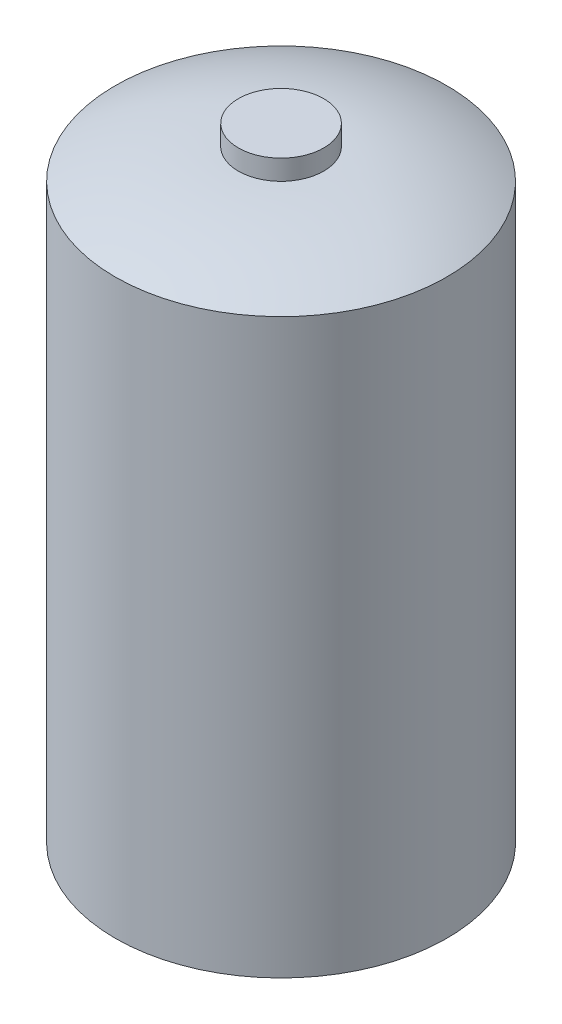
ISO-10303-21;
HEADER;
FILE_DESCRIPTION(('STEP AP214'),'2;1');
FILE_NAME('part.step','',(''),(''),'','','');
FILE_SCHEMA(('AUTOMOTIVE_DESIGN { 1 0 10303 214 1 1 1 1 }'));
ENDSEC;
DATA;
#1=APPLICATION_CONTEXT('core data for automotive mechanical design processes');
#2=APPLICATION_PROTOCOL_DEFINITION('international standard','automotive_design',2000,#1);
#3=PRODUCT_CONTEXT('',#1,'mechanical');
#4=PRODUCT('Part','Part','',(#3));
#5=PRODUCT_RELATED_PRODUCT_CATEGORY('part','',(#4));
#6=PRODUCT_DEFINITION_FORMATION('','',#4);
#7=PRODUCT_DEFINITION_CONTEXT('part definition',#1,'design');
#8=PRODUCT_DEFINITION('design','',#6,#7);
#9=PRODUCT_DEFINITION_SHAPE('','',#8);
#10=(LENGTH_UNIT() NAMED_UNIT(*) SI_UNIT(.MILLI.,.METRE.));
#11=(NAMED_UNIT(*) PLANE_ANGLE_UNIT() SI_UNIT($,.RADIAN.));
#12=(NAMED_UNIT(*) SI_UNIT($,.STERADIAN.) SOLID_ANGLE_UNIT());
#13=UNCERTAINTY_MEASURE_WITH_UNIT(LENGTH_MEASURE(1.E-05),#10,'distance_accuracy_value','');
#14=(GEOMETRIC_REPRESENTATION_CONTEXT(3) GLOBAL_UNCERTAINTY_ASSIGNED_CONTEXT((#13)) GLOBAL_UNIT_ASSIGNED_CONTEXT((#10,
#11,#12)) REPRESENTATION_CONTEXT('',''));
#15=CARTESIAN_POINT('',(0.,0.,0.));
#16=DIRECTION('',(0.,0.,1.));
#17=DIRECTION('',(1.,0.,0.));
#18=AXIS2_PLACEMENT_3D('',#15,#16,#17);
#19=CARTESIAN_POINT('',(0.,0.,0.));
#20=DIRECTION('',(0.,-1.,0.));
#21=DIRECTION('',(0.,0.,-1.));
#22=AXIS2_PLACEMENT_3D('',#19,#20,#21);
#23=PLANE('',#22);
#24=CARTESIAN_POINT('',(0.,0.,0.));
#25=DIRECTION('',(0.,1.,0.));
#26=DIRECTION('',(0.,0.,1.));
#27=AXIS2_PLACEMENT_3D('',#24,#25,#26);
#28=CIRCLE('',#27,4.25);
#29=CARTESIAN_POINT('',(0.,0.,4.25));
#30=VERTEX_POINT('',#29);
#31=EDGE_CURVE('E10',#30,#30,#28,.T.);
#32=ORIENTED_EDGE('',*,*,#31,.T.);
#33=EDGE_LOOP('',(#32));
#34=FACE_BOUND('',#33,.T.);
#35=ADVANCED_FACE('F31',(#34),#23,.F.);
#36=CARTESIAN_POINT('',(0.,0.,0.));
#37=DIRECTION('',(0.,1.,0.));
#38=DIRECTION('',(0.,0.,1.));
#39=AXIS2_PLACEMENT_3D('',#36,#37,#38);
#40=CYLINDRICAL_SURFACE('',#39,4.25);
#41=ORIENTED_EDGE('',*,*,#31,.F.);
#42=EDGE_LOOP('',(#41));
#43=FACE_BOUND('',#42,.T.);
#44=CARTESIAN_POINT('',(0.,-2.,0.));
#45=DIRECTION('',(0.,1.,0.));
#46=DIRECTION('',(0.,0.,1.));
#47=AXIS2_PLACEMENT_3D('',#44,#45,#46);
#48=CIRCLE('',#47,4.25);
#49=CARTESIAN_POINT('',(0.,-2.,4.25));
#50=VERTEX_POINT('',#49);
#51=EDGE_CURVE('E37',#50,#50,#48,.T.);
#52=ORIENTED_EDGE('',*,*,#51,.T.);
#53=EDGE_LOOP('',(#52));
#54=FACE_BOUND('',#53,.T.);
#55=ADVANCED_FACE('F63',(#43,#54),#40,.T.);
#56=CARTESIAN_POINT('',(0.,-28.5104166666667,0.));
#57=DIRECTION('',(0.,1.,0.));
#58=DIRECTION('',(0.,0.,1.));
#59=AXIS2_PLACEMENT_3D('',#56,#57,#58);
#60=DEGENERATE_TOROIDAL_SURFACE('',#59,4.25,26.5104166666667,.T.);
#61=ORIENTED_EDGE('',*,*,#51,.F.);
#62=EDGE_LOOP('',(#61));
#63=FACE_BOUND('',#62,.T.);
#64=CARTESIAN_POINT('',(0.,-4.99999999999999,0.));
#65=DIRECTION('',(0.,1.,0.));
#66=DIRECTION('',(0.,0.,1.));
#67=AXIS2_PLACEMENT_3D('',#64,#65,#66);
#68=CIRCLE('',#67,16.5);
#69=CARTESIAN_POINT('',(0.,-4.99999999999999,16.5));
#70=VERTEX_POINT('',#69);
#71=EDGE_CURVE('E41',#70,#70,#68,.T.);
#72=ORIENTED_EDGE('',*,*,#71,.T.);
#73=EDGE_LOOP('',(#72));
#74=FACE_BOUND('',#73,.T.);
#75=ADVANCED_FACE('F59',(#63,#74),#60,.T.);
#76=CARTESIAN_POINT('',(0.,0.,0.));
#77=DIRECTION('',(0.,1.,0.));
#78=DIRECTION('',(0.,0.,1.));
#79=AXIS2_PLACEMENT_3D('',#76,#77,#78);
#80=CYLINDRICAL_SURFACE('',#79,16.5);
#81=ORIENTED_EDGE('',*,*,#71,.F.);
#82=EDGE_LOOP('',(#81));
#83=FACE_BOUND('',#82,.T.);
#84=CARTESIAN_POINT('',(0.,-62.,0.));
#85=DIRECTION('',(0.,1.,0.));
#86=DIRECTION('',(0.,0.,1.));
#87=AXIS2_PLACEMENT_3D('',#84,#85,#86);
#88=CIRCLE('',#87,16.5);
#89=CARTESIAN_POINT('',(0.,-62.,16.5));
#90=VERTEX_POINT('',#89);
#91=EDGE_CURVE('E45',#90,#90,#88,.T.);
#92=ORIENTED_EDGE('',*,*,#91,.T.);
#93=EDGE_LOOP('',(#92));
#94=FACE_BOUND('',#93,.T.);
#95=ADVANCED_FACE('F51',(#83,#94),#80,.T.);
#96=CARTESIAN_POINT('',(0.,-62.,0.));
#97=DIRECTION('',(0.,1.,0.));
#98=DIRECTION('',(0.,0.,1.));
#99=AXIS2_PLACEMENT_3D('',#96,#97,#98);
#100=PLANE('',#99);
#101=ORIENTED_EDGE('',*,*,#91,.F.);
#102=EDGE_LOOP('',(#101));
#103=FACE_BOUND('',#102,.T.);
#104=ADVANCED_FACE('F53',(#103),#100,.F.);
#105=CLOSED_SHELL('',(#35,#55,#75,#95,#104));
#106=MANIFOLD_SOLID_BREP('B2',#105);
#107=ADVANCED_BREP_SHAPE_REPRESENTATION('',(#18,#106),#14);
#108=SHAPE_DEFINITION_REPRESENTATION(#9,#107);
ENDSEC;
END-ISO-10303-21;
